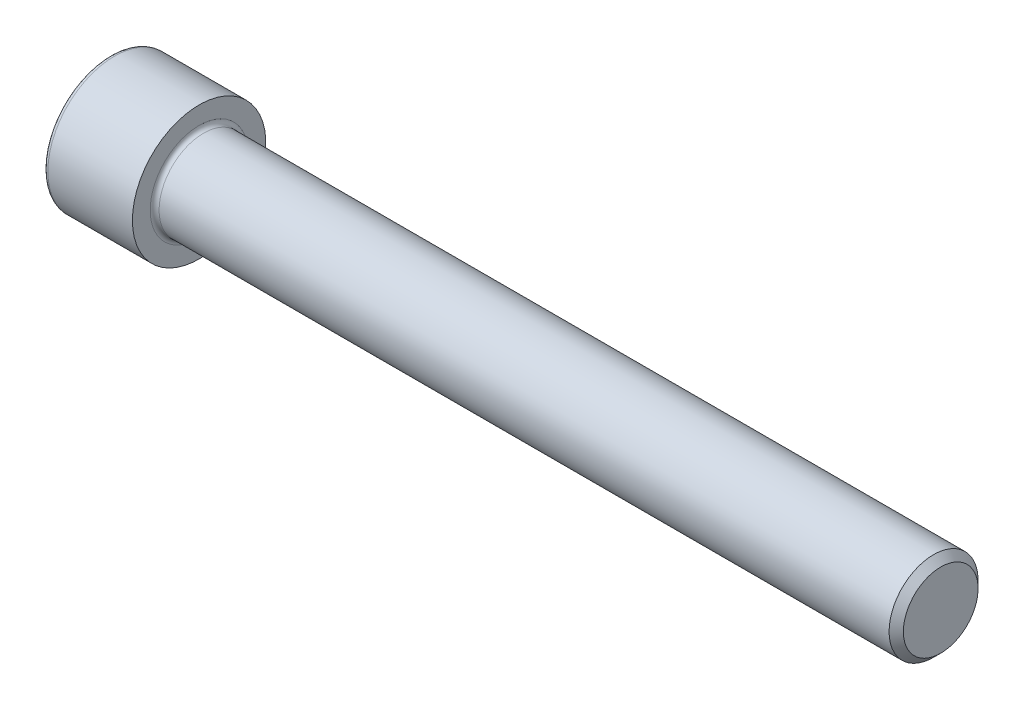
from build123d import *

# Parameters (mm, degrees)
FILLET1_R   = 0.6
FILLET2_R   = 0.6
HEX_2_DEPTH = 6


with BuildPart() as part:
    # BodySke → Base-Revolve (revolve)
    with BuildSketch(Plane.XY, mode=Mode.PRIVATE) as base_revolve_sk:
        Polygon((0, 0), (0, 9), (12, 9), (12, 6), (111.036, 6), (112, 5.036), (112, 0), align=None)
    revolve(base_revolve_sk.sketch.rotate(Axis((-31.75, 0, 0), (1, 0, 0)), 90), axis=Axis((-31.75, 0, 0), (1, 0, 0)))

    # Fillet1
    fillet1_edges = [part.edges().sort_by_distance(p)[0] for p in [
        (12, 0, -6),
    ]]
    fillet(fillet1_edges, radius=FILLET1_R)

    # Fillet2
    fillet2_edges = [part.edges().sort_by_distance(p)[0] for p in [
        (0, 0, -9),
    ]]
    fillet(fillet2_edges, radius=FILLET2_R)

    # Sketch2 → Hex-PreBroach (revolve, cut)
    with BuildSketch(Plane.XY, mode=Mode.PRIVATE) as hex_prebroach_sk:
        Polygon((0, 5.0575), (6, 5.0575), (8.919948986, 0), (0, 0), align=None)
    revolve(hex_prebroach_sk.sketch.rotate(Axis((0, 0, 0), (1, 0, 0)), 90), axis=Axis((0, 0, 0), (1, 0, 0)), mode=Mode.SUBTRACT)

    # Sketch3 → Hex 2 (cut)
    with BuildSketch(Plane(origin=(0, 0, 0), x_dir=(0, 0.500000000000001, 0.866025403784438), z_dir=(-1, 0, 0))):
        Polygon((2.919948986, 5.0575), (-2.919948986, 5.0575), (-5.839897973, 0), (-2.919948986, -5.0575), (2.919948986, -5.0575), (5.839897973, 0), align=None)
    extrude(amount=-HEX_2_DEPTH, mode=Mode.SUBTRACT)


solid = part.part
